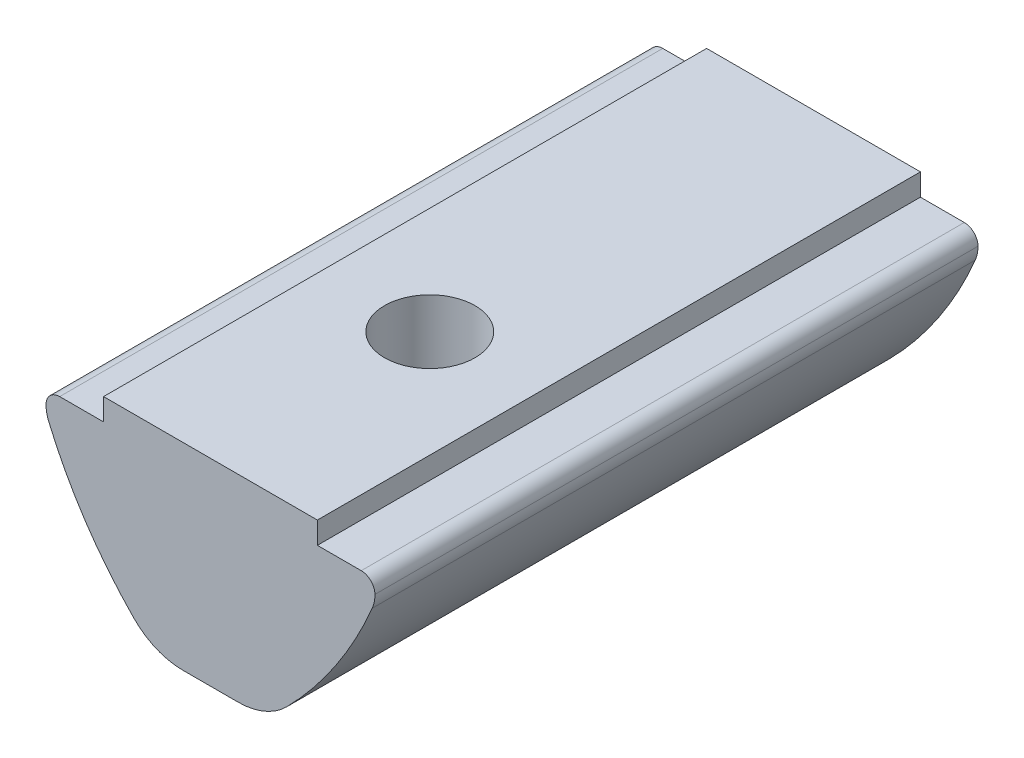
ISO-10303-21;
HEADER;
FILE_DESCRIPTION(('STEP AP214'),'2;1');
FILE_NAME('part.step','',(''),(''),'','','');
FILE_SCHEMA(('AUTOMOTIVE_DESIGN { 1 0 10303 214 1 1 1 1 }'));
ENDSEC;
DATA;
#1=APPLICATION_CONTEXT('core data for automotive mechanical design processes');
#2=APPLICATION_PROTOCOL_DEFINITION('international standard','automotive_design',2000,#1);
#3=PRODUCT_CONTEXT('',#1,'mechanical');
#4=PRODUCT('Part','Part','',(#3));
#5=PRODUCT_RELATED_PRODUCT_CATEGORY('part','',(#4));
#6=PRODUCT_DEFINITION_FORMATION('','',#4);
#7=PRODUCT_DEFINITION_CONTEXT('part definition',#1,'design');
#8=PRODUCT_DEFINITION('design','',#6,#7);
#9=PRODUCT_DEFINITION_SHAPE('','',#8);
#10=(LENGTH_UNIT() NAMED_UNIT(*) SI_UNIT(.MILLI.,.METRE.));
#11=(NAMED_UNIT(*) PLANE_ANGLE_UNIT() SI_UNIT($,.RADIAN.));
#12=(NAMED_UNIT(*) SI_UNIT($,.STERADIAN.) SOLID_ANGLE_UNIT());
#13=UNCERTAINTY_MEASURE_WITH_UNIT(LENGTH_MEASURE(1.E-05),#10,'distance_accuracy_value','');
#14=(GEOMETRIC_REPRESENTATION_CONTEXT(3) GLOBAL_UNCERTAINTY_ASSIGNED_CONTEXT((#13)) GLOBAL_UNIT_ASSIGNED_CONTEXT((#10,
#11,#12)) REPRESENTATION_CONTEXT('',''));
#15=CARTESIAN_POINT('',(0.,0.,0.));
#16=DIRECTION('',(0.,0.,1.));
#17=DIRECTION('',(1.,0.,0.));
#18=AXIS2_PLACEMENT_3D('',#15,#16,#17);
#19=CARTESIAN_POINT('',(-2.,-7.2,22.));
#20=DIRECTION('',(0.,1.,0.));
#21=DIRECTION('',(1.,0.,0.));
#22=AXIS2_PLACEMENT_3D('',#19,#20,#21);
#23=PLANE('',#22);
#24=CARTESIAN_POINT('',(0.,-7.2,5.));
#25=DIRECTION('',(0.,-1.,0.));
#26=DIRECTION('',(1.,0.,0.));
#27=AXIS2_PLACEMENT_3D('',#24,#25,#26);
#28=CIRCLE('',#27,2.5);
#29=CARTESIAN_POINT('',(1.00631416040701,-7.2,7.28852175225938));
#30=VERTEX_POINT('',#29);
#31=CARTESIAN_POINT('',(-1.00631416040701,-7.2,7.28852175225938));
#32=VERTEX_POINT('',#31);
#33=EDGE_CURVE('E708',#30,#32,#28,.T.);
#34=ORIENTED_EDGE('',*,*,#33,.F.);
#35=DIRECTION('',(0.,0.,1.));
#36=VECTOR('',#35,1.);
#37=CARTESIAN_POINT('',(1.00631416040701,-7.2,22.));
#38=LINE('',#37,#36);
#39=CARTESIAN_POINT('',(1.00631416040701,-7.2,12.6923946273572));
#40=VERTEX_POINT('',#39);
#41=EDGE_CURVE('E711',#30,#40,#38,.T.);
#42=ORIENTED_EDGE('',*,*,#41,.T.);
#43=CARTESIAN_POINT('',(0.,-7.2,14.));
#44=DIRECTION('',(0.,1.,0.));
#45=DIRECTION('',(-1.,0.,0.));
#46=AXIS2_PLACEMENT_3D('',#43,#44,#45);
#47=CIRCLE('',#46,1.65);
#48=CARTESIAN_POINT('',(-1.00631416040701,-7.2,12.6923946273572));
#49=VERTEX_POINT('',#48);
#50=EDGE_CURVE('E743',#40,#49,#47,.T.);
#51=ORIENTED_EDGE('',*,*,#50,.T.);
#52=DIRECTION('',(0.,0.,1.));
#53=VECTOR('',#52,1.);
#54=CARTESIAN_POINT('',(-1.00631416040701,-7.2,6.49999999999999));
#55=LINE('',#54,#53);
#56=EDGE_CURVE('E714',#49,#32,#55,.F.);
#57=ORIENTED_EDGE('',*,*,#56,.T.);
#58=EDGE_LOOP('',(#34,#42,#51,#57));
#59=FACE_BOUND('',#58,.T.);
#60=ADVANCED_FACE('F53',(#59),#23,.F.);
#61=CARTESIAN_POINT('',(-1.00631416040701,-7.2,15.3076053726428));
#62=VERTEX_POINT('',#61);
#63=CARTESIAN_POINT('',(1.00631416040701,-7.2,15.3076053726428));
#64=VERTEX_POINT('',#63);
#65=EDGE_CURVE('E741',#62,#64,#47,.T.);
#66=ORIENTED_EDGE('',*,*,#65,.T.);
#67=DIRECTION('',(0.,0.,1.));
#68=VECTOR('',#67,1.);
#69=CARTESIAN_POINT('',(1.00631416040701,-7.2,22.));
#70=LINE('',#69,#68);
#71=CARTESIAN_POINT('',(1.00631416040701,-7.2,22.));
#72=VERTEX_POINT('',#71);
#73=EDGE_CURVE('E69',#64,#72,#70,.T.);
#74=ORIENTED_EDGE('',*,*,#73,.T.);
#75=DIRECTION('',(1.,0.,0.));
#76=VECTOR('',#75,1.);
#77=CARTESIAN_POINT('',(-2.,-7.2,22.));
#78=LINE('',#77,#76);
#79=CARTESIAN_POINT('',(-1.00631416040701,-7.2,22.));
#80=VERTEX_POINT('',#79);
#81=EDGE_CURVE('E210',#80,#72,#78,.T.);
#82=ORIENTED_EDGE('',*,*,#81,.F.);
#83=DIRECTION('',(0.,0.,1.));
#84=VECTOR('',#83,1.);
#85=CARTESIAN_POINT('',(-1.00631416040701,-7.2,6.49999999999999));
#86=LINE('',#85,#84);
#87=EDGE_CURVE('E727',#80,#62,#86,.F.);
#88=ORIENTED_EDGE('',*,*,#87,.T.);
#89=EDGE_LOOP('',(#66,#74,#82,#88));
#90=FACE_BOUND('',#89,.T.);
#91=ADVANCED_FACE('F683',(#90),#23,.F.);
#92=CARTESIAN_POINT('',(3.9,-0.8,22.));
#93=DIRECTION('',(0.,-1.,0.));
#94=DIRECTION('',(-1.,0.,0.));
#95=AXIS2_PLACEMENT_3D('',#92,#93,#94);
#96=PLANE('',#95);
#97=DIRECTION('',(-1.,0.,0.));
#98=VECTOR('',#97,1.);
#99=CARTESIAN_POINT('',(-3.9,-0.8,0.));
#100=LINE('',#99,#98);
#101=CARTESIAN_POINT('',(-3.9,-0.8,0.));
#102=VERTEX_POINT('',#101);
#103=CARTESIAN_POINT('',(-5.5,-0.8,0.));
#104=VERTEX_POINT('',#103);
#105=EDGE_CURVE('E522',#102,#104,#100,.T.);
#106=ORIENTED_EDGE('',*,*,#105,.T.);
#107=DIRECTION('',(0.,0.,1.));
#108=VECTOR('',#107,1.);
#109=CARTESIAN_POINT('',(-5.5,-0.799999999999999,22.));
#110=LINE('',#109,#108);
#111=CARTESIAN_POINT('',(-5.5,-0.8,22.));
#112=VERTEX_POINT('',#111);
#113=EDGE_CURVE('E573',#104,#112,#110,.T.);
#114=ORIENTED_EDGE('',*,*,#113,.T.);
#115=DIRECTION('',(-1.,0.,0.));
#116=VECTOR('',#115,1.);
#117=CARTESIAN_POINT('',(-3.9,-0.8,22.));
#118=LINE('',#117,#116);
#119=CARTESIAN_POINT('',(-3.9,-0.8,22.));
#120=VERTEX_POINT('',#119);
#121=EDGE_CURVE('E546',#120,#112,#118,.T.);
#122=ORIENTED_EDGE('',*,*,#121,.F.);
#123=DIRECTION('',(0.,0.,1.));
#124=VECTOR('',#123,1.);
#125=CARTESIAN_POINT('',(-3.89999999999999,-0.8,22.));
#126=LINE('',#125,#124);
#127=EDGE_CURVE('E206',#102,#120,#126,.T.);
#128=ORIENTED_EDGE('',*,*,#127,.F.);
#129=EDGE_LOOP('',(#106,#114,#122,#128));
#130=FACE_BOUND('',#129,.T.);
#131=ADVANCED_FACE('F572',(#130),#96,.F.);
#132=CARTESIAN_POINT('',(5.5,-0.799999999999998,22.));
#133=VERTEX_POINT('',#132);
#134=CARTESIAN_POINT('',(3.9,-0.799999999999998,22.));
#135=VERTEX_POINT('',#134);
#136=EDGE_CURVE('E542',#133,#135,#118,.T.);
#137=ORIENTED_EDGE('',*,*,#136,.F.);
#138=DIRECTION('',(0.,0.,1.));
#139=VECTOR('',#138,1.);
#140=CARTESIAN_POINT('',(5.5,-0.8,0.));
#141=LINE('',#140,#139);
#142=CARTESIAN_POINT('',(5.5,-0.799999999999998,0.));
#143=VERTEX_POINT('',#142);
#144=EDGE_CURVE('E590',#133,#143,#141,.F.);
#145=ORIENTED_EDGE('',*,*,#144,.T.);
#146=CARTESIAN_POINT('',(3.9,-0.8,0.));
#147=VERTEX_POINT('',#146);
#148=EDGE_CURVE('E371',#143,#147,#100,.T.);
#149=ORIENTED_EDGE('',*,*,#148,.T.);
#150=DIRECTION('',(0.,0.,-1.));
#151=VECTOR('',#150,1.);
#152=CARTESIAN_POINT('',(3.9,-0.8,0.));
#153=LINE('',#152,#151);
#154=EDGE_CURVE('E203',#135,#147,#153,.T.);
#155=ORIENTED_EDGE('',*,*,#154,.F.);
#156=EDGE_LOOP('',(#137,#145,#149,#155));
#157=FACE_BOUND('',#156,.T.);
#158=ADVANCED_FACE('F686',(#157),#96,.F.);
#159=CARTESIAN_POINT('',(-5.5,-1.3,0.));
#160=DIRECTION('',(0.,0.,1.));
#161=DIRECTION('',(1.,0.,0.));
#162=AXIS2_PLACEMENT_3D('',#159,#160,#161);
#163=PLANE('',#162);
#164=DIRECTION('',(1.,0.,0.));
#165=VECTOR('',#164,1.);
#166=CARTESIAN_POINT('',(-2.,-7.2,0.));
#167=LINE('',#166,#165);
#168=CARTESIAN_POINT('',(-1.00631416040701,-7.2,0.));
#169=VERTEX_POINT('',#168);
#170=CARTESIAN_POINT('',(1.00631416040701,-7.2,0.));
#171=VERTEX_POINT('',#170);
#172=EDGE_CURVE('E245',#169,#171,#167,.T.);
#173=ORIENTED_EDGE('',*,*,#172,.F.);
#174=CARTESIAN_POINT('',(-1.00631416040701,-4.7,0.));
#175=DIRECTION('',(0.,0.,1.));
#176=DIRECTION('',(1.,0.,0.));
#177=AXIS2_PLACEMENT_3D('',#174,#175,#176);
#178=CIRCLE('',#177,2.5);
#179=CARTESIAN_POINT('',(-2.79027251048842,-6.45142587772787,0.));
#180=VERTEX_POINT('',#179);
#181=EDGE_CURVE('E956',#169,#180,#178,.F.);
#182=ORIENTED_EDGE('',*,*,#181,.T.);
#183=CARTESIAN_POINT('',(7.91347759,4.05712938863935,0.));
#184=DIRECTION('',(0.,0.,1.));
#185=DIRECTION('',(1.,0.,0.));
#186=AXIS2_PLACEMENT_3D('',#183,#184,#185);
#187=CIRCLE('',#186,15.);
#188=CARTESIAN_POINT('',(-5.90122523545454,-1.78701176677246,0.));
#189=VERTEX_POINT('',#188);
#190=EDGE_CURVE('E239',#189,#180,#187,.T.);
#191=ORIENTED_EDGE('',*,*,#190,.F.);
#192=CARTESIAN_POINT('',(-4.75,-1.30000000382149,0.));
#193=DIRECTION('',(0.,0.,1.));
#194=DIRECTION('',(1.,0.,0.));
#195=AXIS2_PLACEMENT_3D('',#192,#193,#194);
#196=CIRCLE('',#195,1.25);
#197=CARTESIAN_POINT('',(-6.,-1.29999999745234,0.));
#198=VERTEX_POINT('',#197);
#199=EDGE_CURVE('E526',#198,#189,#196,.T.);
#200=ORIENTED_EDGE('',*,*,#199,.F.);
#201=CARTESIAN_POINT('',(-5.5,-1.3,0.));
#202=DIRECTION('',(0.,0.,1.));
#203=DIRECTION('',(1.,0.,0.));
#204=AXIS2_PLACEMENT_3D('',#201,#202,#203);
#205=CIRCLE('',#204,0.5);
#206=EDGE_CURVE('E578',#198,#104,#205,.F.);
#207=ORIENTED_EDGE('',*,*,#206,.T.);
#208=ORIENTED_EDGE('',*,*,#105,.F.);
#209=DIRECTION('',(0.,-1.,0.));
#210=VECTOR('',#209,1.);
#211=CARTESIAN_POINT('',(-3.9,0.,0.));
#212=LINE('',#211,#210);
#213=CARTESIAN_POINT('',(-3.9,0.,0.));
#214=VERTEX_POINT('',#213);
#215=EDGE_CURVE('E976',#214,#102,#212,.T.);
#216=ORIENTED_EDGE('',*,*,#215,.F.);
#217=DIRECTION('',(-1.,0.,0.));
#218=VECTOR('',#217,1.);
#219=CARTESIAN_POINT('',(-3.9,0.,0.));
#220=LINE('',#219,#218);
#221=CARTESIAN_POINT('',(3.9,0.,0.));
#222=VERTEX_POINT('',#221);
#223=EDGE_CURVE('E199',#222,#214,#220,.T.);
#224=ORIENTED_EDGE('',*,*,#223,.F.);
#225=DIRECTION('',(0.,-1.,0.));
#226=VECTOR('',#225,1.);
#227=CARTESIAN_POINT('',(3.9,0.,0.));
#228=LINE('',#227,#226);
#229=EDGE_CURVE('E212',#222,#147,#228,.T.);
#230=ORIENTED_EDGE('',*,*,#229,.T.);
#231=ORIENTED_EDGE('',*,*,#148,.F.);
#232=CARTESIAN_POINT('',(5.5,-1.3,0.));
#233=DIRECTION('',(0.,0.,1.));
#234=DIRECTION('',(1.,0.,0.));
#235=AXIS2_PLACEMENT_3D('',#232,#233,#234);
#236=CIRCLE('',#235,0.5);
#237=CARTESIAN_POINT('',(6.,-1.29999999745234,0.));
#238=VERTEX_POINT('',#237);
#239=EDGE_CURVE('E552',#143,#238,#236,.F.);
#240=ORIENTED_EDGE('',*,*,#239,.T.);
#241=CARTESIAN_POINT('',(4.75,-1.30000000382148,0.));
#242=DIRECTION('',(0.,0.,1.));
#243=DIRECTION('',(-1.,0.,0.));
#244=AXIS2_PLACEMENT_3D('',#241,#242,#243);
#245=CIRCLE('',#244,1.25);
#246=CARTESIAN_POINT('',(5.90122523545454,-1.78701176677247,0.));
#247=VERTEX_POINT('',#246);
#248=EDGE_CURVE('E220',#247,#238,#245,.T.);
#249=ORIENTED_EDGE('',*,*,#248,.F.);
#250=CARTESIAN_POINT('',(-7.91347759,4.05712938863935,0.));
#251=DIRECTION('',(0.,0.,1.));
#252=DIRECTION('',(-1.,0.,0.));
#253=AXIS2_PLACEMENT_3D('',#250,#251,#252);
#254=CIRCLE('',#253,15.);
#255=CARTESIAN_POINT('',(2.79027251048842,-6.45142587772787,0.));
#256=VERTEX_POINT('',#255);
#257=EDGE_CURVE('E249',#256,#247,#254,.T.);
#258=ORIENTED_EDGE('',*,*,#257,.F.);
#259=CARTESIAN_POINT('',(1.00631416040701,-4.7,0.));
#260=DIRECTION('',(0.,0.,1.));
#261=DIRECTION('',(1.,0.,0.));
#262=AXIS2_PLACEMENT_3D('',#259,#260,#261);
#263=CIRCLE('',#262,2.5);
#264=EDGE_CURVE('E958',#256,#171,#263,.F.);
#265=ORIENTED_EDGE('',*,*,#264,.T.);
#266=EDGE_LOOP('',(#173,#182,#191,#200,#207,#208,#216,#224,#230,#231,#240,#249,#258,#265));
#267=FACE_BOUND('',#266,.T.);
#268=ADVANCED_FACE('F649',(#267),#163,.F.);
#269=CARTESIAN_POINT('',(-5.5,-1.3,22.));
#270=DIRECTION('',(0.,0.,1.));
#271=DIRECTION('',(1.,0.,0.));
#272=AXIS2_PLACEMENT_3D('',#269,#270,#271);
#273=PLANE('',#272);
#274=ORIENTED_EDGE('',*,*,#81,.T.);
#275=CARTESIAN_POINT('',(1.00631416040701,-4.7,22.));
#276=DIRECTION('',(0.,0.,1.));
#277=DIRECTION('',(1.,0.,0.));
#278=AXIS2_PLACEMENT_3D('',#275,#276,#277);
#279=CIRCLE('',#278,2.5);
#280=CARTESIAN_POINT('',(2.79027251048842,-6.45142587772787,22.));
#281=VERTEX_POINT('',#280);
#282=EDGE_CURVE('E13',#72,#281,#279,.T.);
#283=ORIENTED_EDGE('',*,*,#282,.T.);
#284=CARTESIAN_POINT('',(-7.91347759,4.05712938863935,22.));
#285=DIRECTION('',(0.,0.,1.));
#286=DIRECTION('',(-1.,0.,0.));
#287=AXIS2_PLACEMENT_3D('',#284,#285,#286);
#288=CIRCLE('',#287,15.);
#289=CARTESIAN_POINT('',(5.90122523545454,-1.78701176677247,22.));
#290=VERTEX_POINT('',#289);
#291=EDGE_CURVE('E216',#281,#290,#288,.T.);
#292=ORIENTED_EDGE('',*,*,#291,.T.);
#293=CARTESIAN_POINT('',(4.75,-1.30000000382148,22.));
#294=DIRECTION('',(0.,0.,1.));
#295=DIRECTION('',(-1.,0.,0.));
#296=AXIS2_PLACEMENT_3D('',#293,#294,#295);
#297=CIRCLE('',#296,1.25);
#298=CARTESIAN_POINT('',(6.,-1.29999999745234,22.));
#299=VERTEX_POINT('',#298);
#300=EDGE_CURVE('E518',#290,#299,#297,.T.);
#301=ORIENTED_EDGE('',*,*,#300,.T.);
#302=CARTESIAN_POINT('',(5.5,-1.3,22.));
#303=DIRECTION('',(0.,0.,1.));
#304=DIRECTION('',(1.,0.,0.));
#305=AXIS2_PLACEMENT_3D('',#302,#303,#304);
#306=CIRCLE('',#305,0.5);
#307=EDGE_CURVE('E580',#299,#133,#306,.T.);
#308=ORIENTED_EDGE('',*,*,#307,.T.);
#309=ORIENTED_EDGE('',*,*,#136,.T.);
#310=DIRECTION('',(0.,-1.,0.));
#311=VECTOR('',#310,1.);
#312=CARTESIAN_POINT('',(3.9,0.,22.));
#313=LINE('',#312,#311);
#314=CARTESIAN_POINT('',(3.9,0.,22.));
#315=VERTEX_POINT('',#314);
#316=EDGE_CURVE('E190',#315,#135,#313,.T.);
#317=ORIENTED_EDGE('',*,*,#316,.F.);
#318=DIRECTION('',(1.,0.,0.));
#319=VECTOR('',#318,1.);
#320=CARTESIAN_POINT('',(3.9,0.,22.));
#321=LINE('',#320,#319);
#322=CARTESIAN_POINT('',(-3.89999999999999,0.,22.));
#323=VERTEX_POINT('',#322);
#324=EDGE_CURVE('E182',#323,#315,#321,.T.);
#325=ORIENTED_EDGE('',*,*,#324,.F.);
#326=DIRECTION('',(0.,-1.,0.));
#327=VECTOR('',#326,1.);
#328=CARTESIAN_POINT('',(-3.89999999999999,0.,22.));
#329=LINE('',#328,#327);
#330=EDGE_CURVE('E187',#323,#120,#329,.T.);
#331=ORIENTED_EDGE('',*,*,#330,.T.);
#332=ORIENTED_EDGE('',*,*,#121,.T.);
#333=CARTESIAN_POINT('',(-5.5,-1.3,22.));
#334=DIRECTION('',(0.,0.,1.));
#335=DIRECTION('',(1.,0.,0.));
#336=AXIS2_PLACEMENT_3D('',#333,#334,#335);
#337=CIRCLE('',#336,0.5);
#338=CARTESIAN_POINT('',(-6.,-1.29999999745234,22.));
#339=VERTEX_POINT('',#338);
#340=EDGE_CURVE('E579',#112,#339,#337,.T.);
#341=ORIENTED_EDGE('',*,*,#340,.T.);
#342=CARTESIAN_POINT('',(-4.75,-1.30000000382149,22.));
#343=DIRECTION('',(0.,0.,1.));
#344=DIRECTION('',(1.,0.,0.));
#345=AXIS2_PLACEMENT_3D('',#342,#343,#344);
#346=CIRCLE('',#345,1.25);
#347=CARTESIAN_POINT('',(-5.90122523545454,-1.78701176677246,22.));
#348=VERTEX_POINT('',#347);
#349=EDGE_CURVE('E369',#339,#348,#346,.T.);
#350=ORIENTED_EDGE('',*,*,#349,.T.);
#351=CARTESIAN_POINT('',(7.91347759,4.05712938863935,22.));
#352=DIRECTION('',(0.,0.,1.));
#353=DIRECTION('',(1.,0.,0.));
#354=AXIS2_PLACEMENT_3D('',#351,#352,#353);
#355=CIRCLE('',#354,15.);
#356=CARTESIAN_POINT('',(-2.79027251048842,-6.45142587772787,22.));
#357=VERTEX_POINT('',#356);
#358=EDGE_CURVE('E246',#348,#357,#355,.T.);
#359=ORIENTED_EDGE('',*,*,#358,.T.);
#360=CARTESIAN_POINT('',(-1.00631416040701,-4.7,22.));
#361=DIRECTION('',(0.,0.,1.));
#362=DIRECTION('',(1.,0.,0.));
#363=AXIS2_PLACEMENT_3D('',#360,#361,#362);
#364=CIRCLE('',#363,2.5);
#365=EDGE_CURVE('E62',#357,#80,#364,.T.);
#366=ORIENTED_EDGE('',*,*,#365,.T.);
#367=EDGE_LOOP('',(#274,#283,#292,#301,#308,#309,#317,#325,#331,#332,#341,#350,#359,#366));
#368=FACE_BOUND('',#367,.T.);
#369=ADVANCED_FACE('F184',(#368),#273,.T.);
#370=CARTESIAN_POINT('',(4.75,-1.30000000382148,22.));
#371=DIRECTION('',(0.,0.,-1.));
#372=DIRECTION('',(-1.,0.,0.));
#373=AXIS2_PLACEMENT_3D('',#370,#371,#372);
#374=CYLINDRICAL_SURFACE('',#373,1.25);
#375=ORIENTED_EDGE('',*,*,#248,.T.);
#376=DIRECTION('',(0.,0.,-1.));
#377=VECTOR('',#376,1.);
#378=CARTESIAN_POINT('',(6.,-1.29999999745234,22.));
#379=LINE('',#378,#377);
#380=EDGE_CURVE('E587',#238,#299,#379,.F.);
#381=ORIENTED_EDGE('',*,*,#380,.T.);
#382=ORIENTED_EDGE('',*,*,#300,.F.);
#383=DIRECTION('',(0.,0.,-1.));
#384=VECTOR('',#383,1.);
#385=CARTESIAN_POINT('',(5.90122523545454,-1.78701176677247,22.));
#386=LINE('',#385,#384);
#387=EDGE_CURVE('E221',#290,#247,#386,.T.);
#388=ORIENTED_EDGE('',*,*,#387,.T.);
#389=EDGE_LOOP('',(#375,#381,#382,#388));
#390=FACE_BOUND('',#389,.T.);
#391=ADVANCED_FACE('F638',(#390),#374,.T.);
#392=CARTESIAN_POINT('',(-7.91347759,4.05712938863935,22.));
#393=DIRECTION('',(0.,0.,-1.));
#394=DIRECTION('',(-1.,0.,0.));
#395=AXIS2_PLACEMENT_3D('',#392,#393,#394);
#396=CYLINDRICAL_SURFACE('',#395,15.);
#397=DIRECTION('',(0.,0.,-1.));
#398=VECTOR('',#397,1.);
#399=CARTESIAN_POINT('',(2.79027251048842,-6.45142587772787,22.));
#400=LINE('',#399,#398);
#401=EDGE_CURVE('E749',#281,#256,#400,.T.);
#402=ORIENTED_EDGE('',*,*,#401,.T.);
#403=ORIENTED_EDGE('',*,*,#257,.T.);
#404=ORIENTED_EDGE('',*,*,#387,.F.);
#405=ORIENTED_EDGE('',*,*,#291,.F.);
#406=EDGE_LOOP('',(#402,#403,#404,#405));
#407=FACE_BOUND('',#406,.T.);
#408=ADVANCED_FACE('F633',(#407),#396,.T.);
#409=CARTESIAN_POINT('',(7.91347759,4.05712938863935,22.));
#410=DIRECTION('',(0.,0.,-1.));
#411=DIRECTION('',(-1.,0.,0.));
#412=AXIS2_PLACEMENT_3D('',#409,#410,#411);
#413=CYLINDRICAL_SURFACE('',#412,15.);
#414=ORIENTED_EDGE('',*,*,#190,.T.);
#415=DIRECTION('',(0.,0.,-1.));
#416=VECTOR('',#415,1.);
#417=CARTESIAN_POINT('',(-2.79027251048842,-6.45142587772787,22.));
#418=LINE('',#417,#416);
#419=EDGE_CURVE('E592',#180,#357,#418,.F.);
#420=ORIENTED_EDGE('',*,*,#419,.T.);
#421=ORIENTED_EDGE('',*,*,#358,.F.);
#422=DIRECTION('',(0.,0.,-1.));
#423=VECTOR('',#422,1.);
#424=CARTESIAN_POINT('',(-5.90122523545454,-1.78701176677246,22.));
#425=LINE('',#424,#423);
#426=EDGE_CURVE('E247',#348,#189,#425,.T.);
#427=ORIENTED_EDGE('',*,*,#426,.T.);
#428=EDGE_LOOP('',(#414,#420,#421,#427));
#429=FACE_BOUND('',#428,.T.);
#430=ADVANCED_FACE('F637',(#429),#413,.T.);
#431=CARTESIAN_POINT('',(-4.75,-1.30000000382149,22.));
#432=DIRECTION('',(0.,0.,-1.));
#433=DIRECTION('',(-1.,0.,0.));
#434=AXIS2_PLACEMENT_3D('',#431,#432,#433);
#435=CYLINDRICAL_SURFACE('',#434,1.25);
#436=ORIENTED_EDGE('',*,*,#349,.F.);
#437=DIRECTION('',(0.,0.,-1.));
#438=VECTOR('',#437,1.);
#439=CARTESIAN_POINT('',(-6.,-1.29999999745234,22.));
#440=LINE('',#439,#438);
#441=EDGE_CURVE('E545',#339,#198,#440,.T.);
#442=ORIENTED_EDGE('',*,*,#441,.T.);
#443=ORIENTED_EDGE('',*,*,#199,.T.);
#444=ORIENTED_EDGE('',*,*,#426,.F.);
#445=EDGE_LOOP('',(#436,#442,#443,#444));
#446=FACE_BOUND('',#445,.T.);
#447=ADVANCED_FACE('F640',(#446),#435,.T.);
#448=CARTESIAN_POINT('',(-1.00631416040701,-7.2,2.71147824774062));
#449=VERTEX_POINT('',#448);
#450=CARTESIAN_POINT('',(1.00631416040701,-7.2,2.71147824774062));
#451=VERTEX_POINT('',#450);
#452=EDGE_CURVE('E717',#449,#451,#28,.T.);
#453=ORIENTED_EDGE('',*,*,#452,.F.);
#454=DIRECTION('',(0.,0.,1.));
#455=VECTOR('',#454,1.);
#456=CARTESIAN_POINT('',(-1.00631416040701,-7.2,0.));
#457=LINE('',#456,#455);
#458=EDGE_CURVE('E961',#449,#169,#457,.F.);
#459=ORIENTED_EDGE('',*,*,#458,.T.);
#460=ORIENTED_EDGE('',*,*,#172,.T.);
#461=DIRECTION('',(0.,0.,1.));
#462=VECTOR('',#461,1.);
#463=CARTESIAN_POINT('',(1.00631416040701,-7.2,3.5));
#464=LINE('',#463,#462);
#465=EDGE_CURVE('E965',#171,#451,#464,.T.);
#466=ORIENTED_EDGE('',*,*,#465,.T.);
#467=EDGE_LOOP('',(#453,#459,#460,#466));
#468=FACE_BOUND('',#467,.T.);
#469=ADVANCED_FACE('F623',(#468),#23,.F.);
#470=CARTESIAN_POINT('',(0.,0.,0.));
#471=DIRECTION('',(0.,-1.,0.));
#472=DIRECTION('',(1.,0.,0.));
#473=AXIS2_PLACEMENT_3D('',#470,#471,#472);
#474=PLANE('',#473);
#475=CARTESIAN_POINT('',(0.,0.,14.));
#476=DIRECTION('',(0.,1.,0.));
#477=DIRECTION('',(0.,0.,1.));
#478=AXIS2_PLACEMENT_3D('',#475,#476,#477);
#479=CIRCLE('',#478,1.65);
#480=CARTESIAN_POINT('',(0.,0.,15.65));
#481=VERTEX_POINT('',#480);
#482=EDGE_CURVE('E971',#481,#481,#479,.T.);
#483=ORIENTED_EDGE('',*,*,#482,.F.);
#484=EDGE_LOOP('',(#483));
#485=FACE_BOUND('',#484,.T.);
#486=DIRECTION('',(0.,0.,1.));
#487=VECTOR('',#486,1.);
#488=CARTESIAN_POINT('',(-3.89999999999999,0.,22.));
#489=LINE('',#488,#487);
#490=EDGE_CURVE('E194',#214,#323,#489,.T.);
#491=ORIENTED_EDGE('',*,*,#490,.T.);
#492=ORIENTED_EDGE('',*,*,#324,.T.);
#493=DIRECTION('',(0.,0.,-1.));
#494=VECTOR('',#493,1.);
#495=CARTESIAN_POINT('',(3.9,0.,0.));
#496=LINE('',#495,#494);
#497=EDGE_CURVE('E193',#315,#222,#496,.T.);
#498=ORIENTED_EDGE('',*,*,#497,.T.);
#499=ORIENTED_EDGE('',*,*,#223,.T.);
#500=EDGE_LOOP('',(#491,#492,#498,#499));
#501=FACE_BOUND('',#500,.T.);
#502=ADVANCED_FACE('F197',(#485,#501),#474,.F.);
#503=CARTESIAN_POINT('',(3.9,0.,0.));
#504=DIRECTION('',(-1.,0.,0.));
#505=DIRECTION('',(0.,-1.,0.));
#506=AXIS2_PLACEMENT_3D('',#503,#504,#505);
#507=PLANE('',#506);
#508=ORIENTED_EDGE('',*,*,#154,.T.);
#509=ORIENTED_EDGE('',*,*,#229,.F.);
#510=ORIENTED_EDGE('',*,*,#497,.F.);
#511=ORIENTED_EDGE('',*,*,#316,.T.);
#512=EDGE_LOOP('',(#508,#509,#510,#511));
#513=FACE_BOUND('',#512,.T.);
#514=ADVANCED_FACE('F622',(#513),#507,.F.);
#515=CARTESIAN_POINT('',(-3.89999999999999,0.,22.));
#516=DIRECTION('',(1.,0.,0.));
#517=DIRECTION('',(0.,0.,-1.));
#518=AXIS2_PLACEMENT_3D('',#515,#516,#517);
#519=PLANE('',#518);
#520=ORIENTED_EDGE('',*,*,#127,.T.);
#521=ORIENTED_EDGE('',*,*,#330,.F.);
#522=ORIENTED_EDGE('',*,*,#490,.F.);
#523=ORIENTED_EDGE('',*,*,#215,.T.);
#524=EDGE_LOOP('',(#520,#521,#522,#523));
#525=FACE_BOUND('',#524,.T.);
#526=ADVANCED_FACE('F205',(#525),#519,.F.);
#527=CARTESIAN_POINT('',(0.,-1.20000000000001,5.));
#528=DIRECTION('',(0.,-1.,0.));
#529=DIRECTION('',(1.,0.,0.));
#530=AXIS2_PLACEMENT_3D('',#527,#528,#529);
#531=CYLINDRICAL_SURFACE('',#530,2.5);
#532=ORIENTED_EDGE('',*,*,#452,.T.);
#533=CARTESIAN_POINT('',(1.00631416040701,-7.2,2.71147824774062));
#534=CARTESIAN_POINT('',(1.06565415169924,-7.20001041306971,2.73755589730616));
#535=CARTESIAN_POINT('',(1.12393286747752,-7.19788807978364,2.76595076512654));
#536=CARTESIAN_POINT('',(1.23784434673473,-7.18990653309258,2.82700845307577));
#537=CARTESIAN_POINT('',(1.29348069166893,-7.18405254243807,2.85966525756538));
#538=CARTESIAN_POINT('',(1.40129350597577,-7.16919660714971,2.92866141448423));
#539=CARTESIAN_POINT('',(1.453495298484,-7.16022175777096,2.9649672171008));
#540=CARTESIAN_POINT('',(1.55466773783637,-7.13966708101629,3.04116809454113));
#541=CARTESIAN_POINT('',(1.60363729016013,-7.12808637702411,3.08106437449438));
#542=CARTESIAN_POINT('',(1.74483641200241,-7.09040299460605,3.20523443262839));
#543=CARTESIAN_POINT('',(1.83201662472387,-7.0612553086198,3.29441580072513));
#544=CARTESIAN_POINT('',(1.99187997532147,-6.99914246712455,3.48412254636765));
#545=CARTESIAN_POINT('',(2.06451412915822,-6.96616498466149,3.58468452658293));
#546=CARTESIAN_POINT('',(2.20304822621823,-6.89649838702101,3.80989967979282));
#547=CARTESIAN_POINT('',(2.26671298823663,-6.85990967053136,3.93597215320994));
#548=CARTESIAN_POINT('',(2.37231367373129,-6.79473856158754,4.19870429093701));
#549=CARTESIAN_POINT('',(2.41429787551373,-6.76613844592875,4.33533964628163));
#550=CARTESIAN_POINT('',(2.46835326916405,-6.72812855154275,4.58735835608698));
#551=CARTESIAN_POINT('',(2.48478151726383,-6.71599297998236,4.70138545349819));
#552=CARTESIAN_POINT('',(2.50170212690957,-6.70348266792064,4.93121705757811));
#553=CARTESIAN_POINT('',(2.50220901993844,-6.70309720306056,5.04701984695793));
#554=CARTESIAN_POINT('',(2.48729076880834,-6.71414517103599,5.27685025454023));
#555=CARTESIAN_POINT('',(2.47188246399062,-6.72556611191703,5.39087961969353));
#556=CARTESIAN_POINT('',(2.42600055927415,-6.75797466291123,5.61447700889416));
#557=CARTESIAN_POINT('',(2.39551110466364,-6.77897233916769,5.72404020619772));
#558=CARTESIAN_POINT('',(2.31837814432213,-6.82854414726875,5.94308124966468));
#559=CARTESIAN_POINT('',(2.27088655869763,-6.85749265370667,6.05217150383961));
#560=CARTESIAN_POINT('',(2.1613020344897,-6.91809051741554,6.26206796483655));
#561=CARTESIAN_POINT('',(2.09918932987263,-6.94974349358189,6.36286270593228));
#562=CARTESIAN_POINT('',(1.94719306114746,-7.01797794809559,6.57437419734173));
#563=CARTESIAN_POINT('',(1.85423563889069,-7.05426749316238,6.68299834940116));
#564=CARTESIAN_POINT('',(1.64975393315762,-7.11813671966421,6.88380102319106));
#565=CARTESIAN_POINT('',(1.53829031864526,-7.14574403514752,6.97603130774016));
#566=CARTESIAN_POINT('',(1.35436269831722,-7.1765174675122,7.10281730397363));
#567=CARTESIAN_POINT('',(1.28756428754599,-7.18508452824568,7.14437895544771));
#568=CARTESIAN_POINT('',(1.14983655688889,-7.19683964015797,7.22129135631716));
#569=CARTESIAN_POINT('',(1.07889771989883,-7.20001474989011,7.25662698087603));
#570=CARTESIAN_POINT('',(1.00631416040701,-7.2,7.28852175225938));
#571=B_SPLINE_CURVE_WITH_KNOTS('',3,(#533,#534,#535,#536,#537,#538,#539,#540,#541,#542,#543,
#544,#545,#546,#547,#548,#549,#550,#551,#552,#553,#554,#555,#556,#557,#558,#559,#560,#561,#562,
#563,#564,#565,#566,#567,#568,#569,#570),.UNSPECIFIED.,.F.,.F.,(4,2,2,2,2,2,2,2,2,2,2,2,2,2,2,2,
2,2,4),(0.,0.194309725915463,0.388348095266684,0.580742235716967,0.773201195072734,
1.15576973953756,1.53960569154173,1.97529307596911,2.41000604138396,2.75596894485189,
3.10161607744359,3.44689786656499,3.79254342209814,4.15861303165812,4.52518039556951,
4.96560379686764,5.40461087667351,5.64153858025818,5.8790341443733),.UNSPECIFIED.);
#572=EDGE_CURVE('E601',#451,#30,#571,.T.);
#573=ORIENTED_EDGE('',*,*,#572,.T.);
#574=ORIENTED_EDGE('',*,*,#33,.T.);
#575=CARTESIAN_POINT('',(-1.00631416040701,-7.2,7.28852175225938));
#576=CARTESIAN_POINT('',(-1.06565415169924,-7.20001041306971,7.26244410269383));
#577=CARTESIAN_POINT('',(-1.12393286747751,-7.19788807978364,7.23404923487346));
#578=CARTESIAN_POINT('',(-1.23784434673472,-7.18990653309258,7.17299154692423));
#579=CARTESIAN_POINT('',(-1.29348069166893,-7.18405254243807,7.14033474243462));
#580=CARTESIAN_POINT('',(-1.40129350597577,-7.16919660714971,7.07133858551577));
#581=CARTESIAN_POINT('',(-1.453495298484,-7.16022175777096,7.0350327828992));
#582=CARTESIAN_POINT('',(-1.55466773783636,-7.13966708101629,6.95883190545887));
#583=CARTESIAN_POINT('',(-1.60363729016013,-7.12808637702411,6.91893562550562));
#584=CARTESIAN_POINT('',(-1.7448364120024,-7.09040299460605,6.7947655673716));
#585=CARTESIAN_POINT('',(-1.83201662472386,-7.0612553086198,6.70558419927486));
#586=CARTESIAN_POINT('',(-1.99187997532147,-6.99914246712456,6.51587745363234));
#587=CARTESIAN_POINT('',(-2.06451412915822,-6.96616498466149,6.41531547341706));
#588=CARTESIAN_POINT('',(-2.20304822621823,-6.89649838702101,6.19010032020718));
#589=CARTESIAN_POINT('',(-2.26671298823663,-6.85990967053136,6.06402784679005));
#590=CARTESIAN_POINT('',(-2.37231367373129,-6.79473856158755,5.80129570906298));
#591=CARTESIAN_POINT('',(-2.41429787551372,-6.76613844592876,5.66466035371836));
#592=CARTESIAN_POINT('',(-2.46835326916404,-6.72812855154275,5.41264164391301));
#593=CARTESIAN_POINT('',(-2.48478151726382,-6.71599297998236,5.2986145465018));
#594=CARTESIAN_POINT('',(-2.50170212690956,-6.70348266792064,5.06878294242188));
#595=CARTESIAN_POINT('',(-2.50220901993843,-6.70309720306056,4.95298015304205));
#596=CARTESIAN_POINT('',(-2.48729076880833,-6.714145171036,4.72314974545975));
#597=CARTESIAN_POINT('',(-2.47188246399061,-6.72556611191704,4.60912038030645));
#598=CARTESIAN_POINT('',(-2.42600055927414,-6.75797466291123,4.38552299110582));
#599=CARTESIAN_POINT('',(-2.39551110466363,-6.7789723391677,4.27595979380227));
#600=CARTESIAN_POINT('',(-2.31837814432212,-6.82854414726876,4.0569187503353));
#601=CARTESIAN_POINT('',(-2.27088655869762,-6.85749265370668,3.94782849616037));
#602=CARTESIAN_POINT('',(-2.16130203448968,-6.91809051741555,3.73793203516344));
#603=CARTESIAN_POINT('',(-2.09918932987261,-6.9497434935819,3.6371372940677));
#604=CARTESIAN_POINT('',(-1.94719306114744,-7.0179779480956,3.42562580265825));
#605=CARTESIAN_POINT('',(-1.85423563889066,-7.05426749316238,3.31700165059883));
#606=CARTESIAN_POINT('',(-1.64975393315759,-7.11813671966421,3.11619897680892));
#607=CARTESIAN_POINT('',(-1.53829031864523,-7.14574403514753,3.02396869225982));
#608=CARTESIAN_POINT('',(-1.3543626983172,-7.1765174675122,2.89718269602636));
#609=CARTESIAN_POINT('',(-1.28756428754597,-7.18508452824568,2.85562104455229));
#610=CARTESIAN_POINT('',(-1.14983655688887,-7.19683964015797,2.77870864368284));
#611=CARTESIAN_POINT('',(-1.07889771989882,-7.20001474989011,2.74337301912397));
#612=CARTESIAN_POINT('',(-1.00631416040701,-7.2,2.71147824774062));
#613=B_SPLINE_CURVE_WITH_KNOTS('',3,(#575,#576,#577,#578,#579,#580,#581,#582,#583,#584,#585,
#586,#587,#588,#589,#590,#591,#592,#593,#594,#595,#596,#597,#598,#599,#600,#601,#602,#603,#604,
#605,#606,#607,#608,#609,#610,#611,#612),.UNSPECIFIED.,.F.,.F.,(4,2,2,2,2,2,2,2,2,2,2,2,2,2,2,2,
2,2,4),(0.,0.194309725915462,0.388348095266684,0.580742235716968,0.773201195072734,
1.15576973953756,1.53960569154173,1.97529307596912,2.41000604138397,2.7559689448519,
3.1016160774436,3.446897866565,3.79254342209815,4.15861303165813,4.52518039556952,
4.96560379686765,5.40461087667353,5.64153858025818,5.87903414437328),.UNSPECIFIED.);
#614=EDGE_CURVE('E594',#32,#449,#613,.T.);
#615=ORIENTED_EDGE('',*,*,#614,.T.);
#616=EDGE_LOOP('',(#532,#573,#574,#615));
#617=FACE_BOUND('',#616,.T.);
#618=CARTESIAN_POINT('',(0.,-1.20000000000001,5.));
#619=DIRECTION('',(0.,-1.,0.));
#620=DIRECTION('',(1.,0.,0.));
#621=AXIS2_PLACEMENT_3D('',#618,#619,#620);
#622=CIRCLE('',#621,2.5);
#623=CARTESIAN_POINT('',(2.5,-1.20000000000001,5.));
#624=VERTEX_POINT('',#623);
#625=EDGE_CURVE('E716',#624,#624,#622,.T.);
#626=ORIENTED_EDGE('',*,*,#625,.F.);
#627=EDGE_LOOP('',(#626));
#628=FACE_BOUND('',#627,.T.);
#629=ADVANCED_FACE('F610',(#617,#628),#531,.F.);
#630=CARTESIAN_POINT('',(0.,-0.3,5.));
#631=DIRECTION('',(0.,-1.,0.));
#632=DIRECTION('',(1.,0.,0.));
#633=AXIS2_PLACEMENT_3D('',#630,#631,#632);
#634=CONICAL_SURFACE('',#633,0.0272703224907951,1.22173047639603);
#635=CARTESIAN_POINT('',(0.,-0.799999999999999,5.));
#636=DIRECTION('',(0.,-1.,0.));
#637=DIRECTION('',(1.,0.,0.));
#638=AXIS2_PLACEMENT_3D('',#635,#636,#637);
#639=CIRCLE('',#638,1.4010090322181);
#640=CARTESIAN_POINT('',(1.40100903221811,-0.799999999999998,5.));
#641=VERTEX_POINT('',#640);
#642=EDGE_CURVE('E207',#641,#641,#639,.F.);
#643=ORIENTED_EDGE('',*,*,#642,.T.);
#644=EDGE_LOOP('',(#643));
#645=FACE_BOUND('',#644,.T.);
#646=ORIENTED_EDGE('',*,*,#625,.T.);
#647=EDGE_LOOP('',(#646));
#648=FACE_BOUND('',#647,.T.);
#649=ADVANCED_FACE('F615',(#645,#648),#634,.F.);
#650=CARTESIAN_POINT('',(0.,-0.8,0.));
#651=DIRECTION('',(0.,-1.,0.));
#652=DIRECTION('',(1.,0.,0.));
#653=AXIS2_PLACEMENT_3D('',#650,#651,#652);
#654=PLANE('',#653);
#655=ORIENTED_EDGE('',*,*,#642,.F.);
#656=EDGE_LOOP('',(#655));
#657=FACE_BOUND('',#656,.T.);
#658=ADVANCED_FACE('F625',(#657),#654,.T.);
#659=CARTESIAN_POINT('',(0.,0.,14.));
#660=DIRECTION('',(0.,1.,0.));
#661=DIRECTION('',(0.,0.,1.));
#662=AXIS2_PLACEMENT_3D('',#659,#660,#661);
#663=CYLINDRICAL_SURFACE('',#662,1.65);
#664=ORIENTED_EDGE('',*,*,#482,.T.);
#665=EDGE_LOOP('',(#664));
#666=FACE_BOUND('',#665,.T.);
#667=ORIENTED_EDGE('',*,*,#50,.F.);
#668=CARTESIAN_POINT('',(1.00631416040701,-7.2,12.6923946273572));
#669=CARTESIAN_POINT('',(1.04270728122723,-7.20000106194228,12.720400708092));
#670=CARTESIAN_POINT('',(1.07790395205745,-7.19920527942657,12.7499093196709));
#671=CARTESIAN_POINT('',(1.14567588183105,-7.19634268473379,12.8117115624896));
#672=CARTESIAN_POINT('',(1.17825240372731,-7.19427648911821,12.8440038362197));
#673=CARTESIAN_POINT('',(1.27163298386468,-7.18666481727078,12.9446318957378));
#674=CARTESIAN_POINT('',(1.3282387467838,-7.17970361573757,13.016835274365));
#675=CARTESIAN_POINT('',(1.4286076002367,-7.16460012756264,13.169384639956));
#676=CARTESIAN_POINT('',(1.47238387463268,-7.1564590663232,13.2497221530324));
#677=CARTESIAN_POINT('',(1.54612143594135,-7.14131711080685,13.4166265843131));
#678=CARTESIAN_POINT('',(1.57608304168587,-7.13431619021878,13.5031933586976));
#679=CARTESIAN_POINT('',(1.62169975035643,-7.12319442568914,13.6818295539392));
#680=CARTESIAN_POINT('',(1.63709702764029,-7.11912577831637,13.7739684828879));
#681=CARTESIAN_POINT('',(1.65213026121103,-7.11515752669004,13.9596035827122));
#682=CARTESIAN_POINT('',(1.65176975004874,-7.11525698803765,14.053099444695));
#683=CARTESIAN_POINT('',(1.63558193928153,-7.11952127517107,14.2355658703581));
#684=CARTESIAN_POINT('',(1.62025680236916,-7.12355410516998,14.3245848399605));
#685=CARTESIAN_POINT('',(1.57536808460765,-7.13448244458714,14.4988115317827));
#686=CARTESIAN_POINT('',(1.54579669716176,-7.14137952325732,14.5840171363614));
#687=CARTESIAN_POINT('',(1.47269844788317,-7.15639876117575,14.7496579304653));
#688=CARTESIAN_POINT('',(1.42896408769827,-7.16453811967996,14.8299996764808));
#689=CARTESIAN_POINT('',(1.32880485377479,-7.17962667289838,14.9823773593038));
#690=CARTESIAN_POINT('',(1.27239800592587,-7.18657753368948,15.0544248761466));
#691=CARTESIAN_POINT('',(1.17908340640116,-7.19422105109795,15.1551594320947));
#692=CARTESIAN_POINT('',(1.14633136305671,-7.19630861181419,15.1876667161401));
#693=CARTESIAN_POINT('',(1.07822502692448,-7.19919801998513,15.2498215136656));
#694=CARTESIAN_POINT('',(1.04287326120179,-7.20000109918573,15.2794717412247));
#695=CARTESIAN_POINT('',(1.00631416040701,-7.2,15.3076053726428));
#696=B_SPLINE_CURVE_WITH_KNOTS('',3,(#668,#669,#670,#671,#672,#673,#674,#675,#676,#677,#678,
#679,#680,#681,#682,#683,#684,#685,#686,#687,#688,#689,#690,#691,#692,#693,#694,#695),
.UNSPECIFIED.,.F.,.F.,(4,2,2,2,2,2,2,2,2,2,2,2,2,4),(0.,0.137660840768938,0.275254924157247,
0.549879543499,0.824220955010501,1.09855603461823,1.3776613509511,1.65670409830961,
1.92669396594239,2.19683194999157,2.47112171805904,2.74502376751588,2.8834447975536,
3.02173300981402),.UNSPECIFIED.);
#697=EDGE_CURVE('E723',#40,#64,#696,.T.);
#698=ORIENTED_EDGE('',*,*,#697,.T.);
#699=ORIENTED_EDGE('',*,*,#65,.F.);
#700=CARTESIAN_POINT('',(-1.00631416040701,-7.2,15.3076053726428));
#701=CARTESIAN_POINT('',(-1.04270728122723,-7.20000106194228,15.279599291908));
#702=CARTESIAN_POINT('',(-1.07790395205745,-7.19920527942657,15.2500906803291));
#703=CARTESIAN_POINT('',(-1.14567588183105,-7.19634268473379,15.1882884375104));
#704=CARTESIAN_POINT('',(-1.17825240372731,-7.19427648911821,15.1559961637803));
#705=CARTESIAN_POINT('',(-1.27163298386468,-7.18666481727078,15.0553681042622));
#706=CARTESIAN_POINT('',(-1.3282387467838,-7.17970361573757,14.983164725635));
#707=CARTESIAN_POINT('',(-1.4286076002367,-7.16460012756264,14.830615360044));
#708=CARTESIAN_POINT('',(-1.47238387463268,-7.15645906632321,14.7502778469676));
#709=CARTESIAN_POINT('',(-1.54612143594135,-7.14131711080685,14.5833734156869));
#710=CARTESIAN_POINT('',(-1.57608304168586,-7.13431619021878,14.4968066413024));
#711=CARTESIAN_POINT('',(-1.62169975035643,-7.12319442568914,14.3181704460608));
#712=CARTESIAN_POINT('',(-1.63709702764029,-7.11912577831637,14.2260315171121));
#713=CARTESIAN_POINT('',(-1.65213026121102,-7.11515752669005,14.0403964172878));
#714=CARTESIAN_POINT('',(-1.65176975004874,-7.11525698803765,13.946900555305));
#715=CARTESIAN_POINT('',(-1.63558193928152,-7.11952127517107,13.7644341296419));
#716=CARTESIAN_POINT('',(-1.62025680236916,-7.12355410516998,13.6754151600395));
#717=CARTESIAN_POINT('',(-1.57536808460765,-7.13448244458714,13.5011884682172));
#718=CARTESIAN_POINT('',(-1.54579669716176,-7.14137952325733,13.4159828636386));
#719=CARTESIAN_POINT('',(-1.47269844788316,-7.15639876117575,13.2503420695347));
#720=CARTESIAN_POINT('',(-1.42896408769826,-7.16453811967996,13.1700003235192));
#721=CARTESIAN_POINT('',(-1.32880485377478,-7.17962667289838,13.0176226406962));
#722=CARTESIAN_POINT('',(-1.27239800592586,-7.18657753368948,12.9455751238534));
#723=CARTESIAN_POINT('',(-1.17908340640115,-7.19422105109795,12.8448405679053));
#724=CARTESIAN_POINT('',(-1.1463313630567,-7.19630861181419,12.8123332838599));
#725=CARTESIAN_POINT('',(-1.07822502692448,-7.19919801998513,12.7501784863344));
#726=CARTESIAN_POINT('',(-1.04287326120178,-7.20000109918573,12.7205282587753));
#727=CARTESIAN_POINT('',(-1.00631416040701,-7.2,12.6923946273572));
#728=B_SPLINE_CURVE_WITH_KNOTS('',3,(#700,#701,#702,#703,#704,#705,#706,#707,#708,#709,#710,
#711,#712,#713,#714,#715,#716,#717,#718,#719,#720,#721,#722,#723,#724,#725,#726,#727),
.UNSPECIFIED.,.F.,.F.,(4,2,2,2,2,2,2,2,2,2,2,2,2,4),(0.,0.137660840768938,0.275254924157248,
0.549879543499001,0.824220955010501,1.09855603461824,1.3776613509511,1.65670409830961,
1.92669396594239,2.19683194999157,2.47112171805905,2.74502376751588,2.88344479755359,
3.02173300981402),.UNSPECIFIED.);
#729=EDGE_CURVE('E724',#62,#49,#728,.T.);
#730=ORIENTED_EDGE('',*,*,#729,.T.);
#731=EDGE_LOOP('',(#667,#698,#699,#730));
#732=FACE_BOUND('',#731,.T.);
#733=ADVANCED_FACE('F617',(#666,#732),#663,.F.);
#734=CARTESIAN_POINT('',(-5.5,-1.3,22.));
#735=DIRECTION('',(0.,0.,-1.));
#736=DIRECTION('',(-1.,0.,0.));
#737=AXIS2_PLACEMENT_3D('',#734,#735,#736);
#738=CYLINDRICAL_SURFACE('',#737,0.5);
#739=ORIENTED_EDGE('',*,*,#340,.F.);
#740=ORIENTED_EDGE('',*,*,#113,.F.);
#741=ORIENTED_EDGE('',*,*,#206,.F.);
#742=ORIENTED_EDGE('',*,*,#441,.F.);
#743=EDGE_LOOP('',(#739,#740,#741,#742));
#744=FACE_BOUND('',#743,.T.);
#745=ADVANCED_FACE('F576',(#744),#738,.T.);
#746=CARTESIAN_POINT('',(5.5,-1.3,22.));
#747=DIRECTION('',(0.,0.,-1.));
#748=DIRECTION('',(-1.,0.,0.));
#749=AXIS2_PLACEMENT_3D('',#746,#747,#748);
#750=CYLINDRICAL_SURFACE('',#749,0.5);
#751=ORIENTED_EDGE('',*,*,#239,.F.);
#752=ORIENTED_EDGE('',*,*,#144,.F.);
#753=ORIENTED_EDGE('',*,*,#307,.F.);
#754=ORIENTED_EDGE('',*,*,#380,.F.);
#755=EDGE_LOOP('',(#751,#752,#753,#754));
#756=FACE_BOUND('',#755,.T.);
#757=ADVANCED_FACE('F693',(#756),#750,.T.);
#758=CARTESIAN_POINT('',(-1.00631416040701,-4.7,22.));
#759=DIRECTION('',(0.,0.,-1.));
#760=DIRECTION('',(-1.,0.,0.));
#761=AXIS2_PLACEMENT_3D('',#758,#759,#760);
#762=CYLINDRICAL_SURFACE('',#761,2.5);
#763=ORIENTED_EDGE('',*,*,#365,.F.);
#764=ORIENTED_EDGE('',*,*,#419,.F.);
#765=ORIENTED_EDGE('',*,*,#181,.F.);
#766=ORIENTED_EDGE('',*,*,#458,.F.);
#767=ORIENTED_EDGE('',*,*,#614,.F.);
#768=ORIENTED_EDGE('',*,*,#56,.F.);
#769=ORIENTED_EDGE('',*,*,#729,.F.);
#770=ORIENTED_EDGE('',*,*,#87,.F.);
#771=EDGE_LOOP('',(#763,#764,#765,#766,#767,#768,#769,#770));
#772=FACE_BOUND('',#771,.T.);
#773=ADVANCED_FACE('F607',(#772),#762,.T.);
#774=CARTESIAN_POINT('',(1.00631416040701,-4.7,22.));
#775=DIRECTION('',(0.,0.,-1.));
#776=DIRECTION('',(-1.,0.,0.));
#777=AXIS2_PLACEMENT_3D('',#774,#775,#776);
#778=CYLINDRICAL_SURFACE('',#777,2.5);
#779=ORIENTED_EDGE('',*,*,#41,.F.);
#780=ORIENTED_EDGE('',*,*,#572,.F.);
#781=ORIENTED_EDGE('',*,*,#465,.F.);
#782=ORIENTED_EDGE('',*,*,#264,.F.);
#783=ORIENTED_EDGE('',*,*,#401,.F.);
#784=ORIENTED_EDGE('',*,*,#282,.F.);
#785=ORIENTED_EDGE('',*,*,#73,.F.);
#786=ORIENTED_EDGE('',*,*,#697,.F.);
#787=EDGE_LOOP('',(#779,#780,#781,#782,#783,#784,#785,#786));
#788=FACE_BOUND('',#787,.T.);
#789=ADVANCED_FACE('F55',(#788),#778,.T.);
#790=CLOSED_SHELL('',(#60,#91,#131,#158,#268,#369,#391,#408,#430,#447,#469,#502,#514,#526,#629,
#649,#658,#733,#745,#757,#773,#789));
#791=MANIFOLD_SOLID_BREP('B2',#790);
#792=ADVANCED_BREP_SHAPE_REPRESENTATION('',(#18,#791),#14);
#793=SHAPE_DEFINITION_REPRESENTATION(#9,#792);
ENDSEC;
END-ISO-10303-21;
